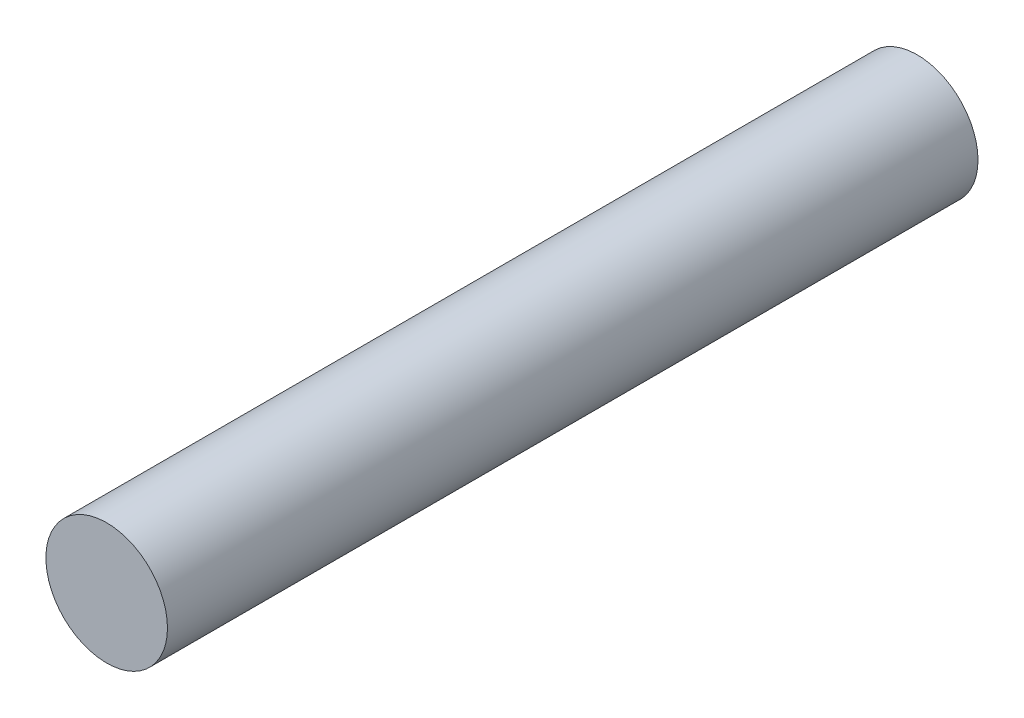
ISO-10303-21;
HEADER;
FILE_DESCRIPTION(('STEP AP214'),'2;1');
FILE_NAME('part.step','',(''),(''),'','','');
FILE_SCHEMA(('AUTOMOTIVE_DESIGN { 1 0 10303 214 1 1 1 1 }'));
ENDSEC;
DATA;
#1=APPLICATION_CONTEXT('core data for automotive mechanical design processes');
#2=APPLICATION_PROTOCOL_DEFINITION('international standard','automotive_design',2000,#1);
#3=PRODUCT_CONTEXT('',#1,'mechanical');
#4=PRODUCT('Part','Part','',(#3));
#5=PRODUCT_RELATED_PRODUCT_CATEGORY('part','',(#4));
#6=PRODUCT_DEFINITION_FORMATION('','',#4);
#7=PRODUCT_DEFINITION_CONTEXT('part definition',#1,'design');
#8=PRODUCT_DEFINITION('design','',#6,#7);
#9=PRODUCT_DEFINITION_SHAPE('','',#8);
#10=(LENGTH_UNIT() NAMED_UNIT(*) SI_UNIT(.MILLI.,.METRE.));
#11=(NAMED_UNIT(*) PLANE_ANGLE_UNIT() SI_UNIT($,.RADIAN.));
#12=(NAMED_UNIT(*) SI_UNIT($,.STERADIAN.) SOLID_ANGLE_UNIT());
#13=UNCERTAINTY_MEASURE_WITH_UNIT(LENGTH_MEASURE(1.E-05),#10,'distance_accuracy_value','');
#14=(GEOMETRIC_REPRESENTATION_CONTEXT(3) GLOBAL_UNCERTAINTY_ASSIGNED_CONTEXT((#13)) GLOBAL_UNIT_ASSIGNED_CONTEXT((#10,
#11,#12)) REPRESENTATION_CONTEXT('',''));
#15=CARTESIAN_POINT('',(0.,0.,0.));
#16=DIRECTION('',(0.,0.,1.));
#17=DIRECTION('',(1.,0.,0.));
#18=AXIS2_PLACEMENT_3D('',#15,#16,#17);
#19=CARTESIAN_POINT('',(0.,0.,-400.));
#20=DIRECTION('',(0.,0.,1.));
#21=DIRECTION('',(1.,0.,0.));
#22=AXIS2_PLACEMENT_3D('',#19,#20,#21);
#23=CYLINDRICAL_SURFACE('',#22,30.);
#24=CARTESIAN_POINT('',(0.,0.,-400.));
#25=DIRECTION('',(0.,0.,1.));
#26=DIRECTION('',(1.,0.,0.));
#27=AXIS2_PLACEMENT_3D('',#24,#25,#26);
#28=CIRCLE('',#27,30.);
#29=CARTESIAN_POINT('',(30.,0.,-400.));
#30=VERTEX_POINT('',#29);
#31=EDGE_CURVE('E10',#30,#30,#28,.T.);
#32=ORIENTED_EDGE('',*,*,#31,.T.);
#33=EDGE_LOOP('',(#32));
#34=FACE_BOUND('',#33,.T.);
#35=CARTESIAN_POINT('',(0.,0.,0.));
#36=DIRECTION('',(0.,0.,1.));
#37=DIRECTION('',(1.,0.,0.));
#38=AXIS2_PLACEMENT_3D('',#35,#36,#37);
#39=CIRCLE('',#38,30.);
#40=CARTESIAN_POINT('',(30.,0.,0.));
#41=VERTEX_POINT('',#40);
#42=EDGE_CURVE('E40',#41,#41,#39,.T.);
#43=ORIENTED_EDGE('',*,*,#42,.F.);
#44=EDGE_LOOP('',(#43));
#45=FACE_BOUND('',#44,.T.);
#46=ADVANCED_FACE('F37',(#34,#45),#23,.T.);
#47=CARTESIAN_POINT('',(0.,0.,-400.));
#48=DIRECTION('',(0.,0.,1.));
#49=DIRECTION('',(1.,0.,0.));
#50=AXIS2_PLACEMENT_3D('',#47,#48,#49);
#51=PLANE('',#50);
#52=ORIENTED_EDGE('',*,*,#31,.F.);
#53=EDGE_LOOP('',(#52));
#54=FACE_BOUND('',#53,.T.);
#55=ADVANCED_FACE('F54',(#54),#51,.F.);
#56=CARTESIAN_POINT('',(0.,0.,0.));
#57=DIRECTION('',(0.,0.,1.));
#58=DIRECTION('',(1.,0.,0.));
#59=AXIS2_PLACEMENT_3D('',#56,#57,#58);
#60=PLANE('',#59);
#61=ORIENTED_EDGE('',*,*,#42,.T.);
#62=EDGE_LOOP('',(#61));
#63=FACE_BOUND('',#62,.T.);
#64=ADVANCED_FACE('F51',(#63),#60,.T.);
#65=CLOSED_SHELL('',(#46,#55,#64));
#66=MANIFOLD_SOLID_BREP('B2',#65);
#67=ADVANCED_BREP_SHAPE_REPRESENTATION('',(#18,#66),#14);
#68=SHAPE_DEFINITION_REPRESENTATION(#9,#67);
ENDSEC;
END-ISO-10303-21;
